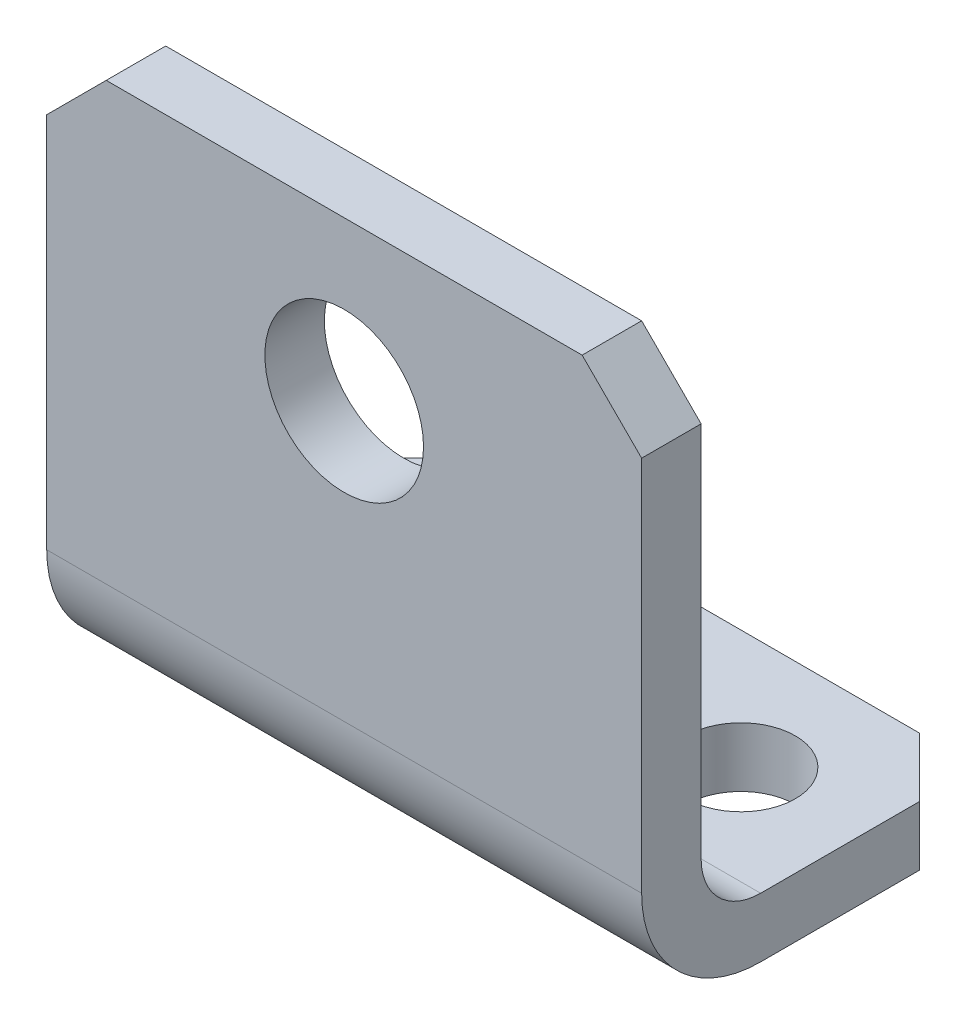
from build123d import *

# Parameters (mm, degrees)
EXTRUDE_1_DEPTH     = 30
SKETCH_2_R          = 4
CUT_EXTRUDE_1_DEPTH = 10
SKETCH_3_R          = 2.75
CUT_EXTRUDE_2_DEPTH = 10
CHAMFER_2_SIZE      = 3


with BuildPart() as part:
    # Sketch 1 → Extrude 1 (new body)
    with BuildSketch(Plane(origin=(0, 0, 0), x_dir=(0, 0, -1), z_dir=(1, 0, 0))):
        with BuildLine():
            Line((0, 0), (3, 0))
            Line((3, 0), (3, -22))
            ThreePointArc((3, -22), (3.878679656, -24.121320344), (6, -25))
            Line((6, -25), (17, -25))
            Line((17, -25), (17, -28))
            Line((17, -28), (6, -28))
            ThreePointArc((6, -28), (1.757359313, -26.242640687), (0, -22))
            Line((0, -22), (0, 0))
        make_face()
    extrude(amount=EXTRUDE_1_DEPTH)

    # Sketch 2 → Cut-Extrude 1 (cut)
    with BuildSketch(Plane.XY):
        with Locations((15, -8)):
            Circle(SKETCH_2_R)
    extrude(amount=-CUT_EXTRUDE_1_DEPTH, mode=Mode.SUBTRACT)

    # Sketch 3 → Cut-Extrude 2 (cut)
    with BuildSketch(Plane.XZ.offset(28)):
        with Locations(Location((6, -11, 0), (0, 0, 270))):
            Circle(SKETCH_3_R)
        with Locations(Location((24, -11, 0), (0, 0, 270))):
            Circle(SKETCH_3_R)
    extrude(amount=-CUT_EXTRUDE_2_DEPTH, mode=Mode.SUBTRACT)

    # Chamfer 2
    chamfer_2_edges = [part.edges().sort_by_distance(p)[0] for p in [
        (30, -26.5, -17),
        (30, 0, -1.5),
        (0, 0, -1.5),
        (0, -26.5, -17),
    ]]
    chamfer(chamfer_2_edges, length=CHAMFER_2_SIZE)


solid = part.part
